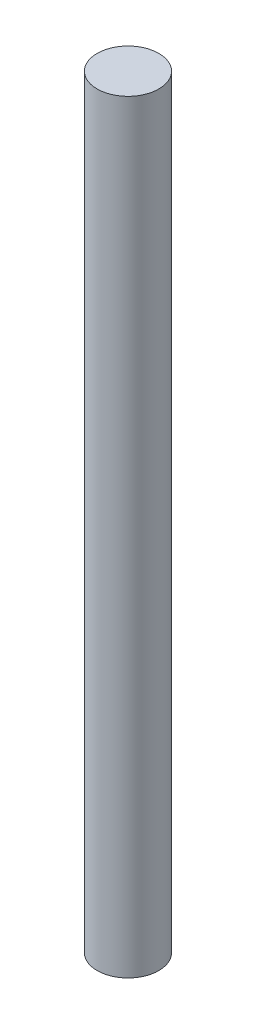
from build123d import *

# Parameters (mm, degrees)
SKETCH1_R      = 13.335
EXTRUDE1_DEPTH = 330.2


with BuildPart() as part:
    # Sketch1 → Extrude1 (new body)
    with BuildSketch(Plane(origin=(0, 0, 0), x_dir=(1, 0, 0), z_dir=(0, 1, 0))):
        with Locations(Location((0, 0, 0), (0, 0, 270))):
            Circle(SKETCH1_R)
    extrude(amount=EXTRUDE1_DEPTH)


solid = part.part
